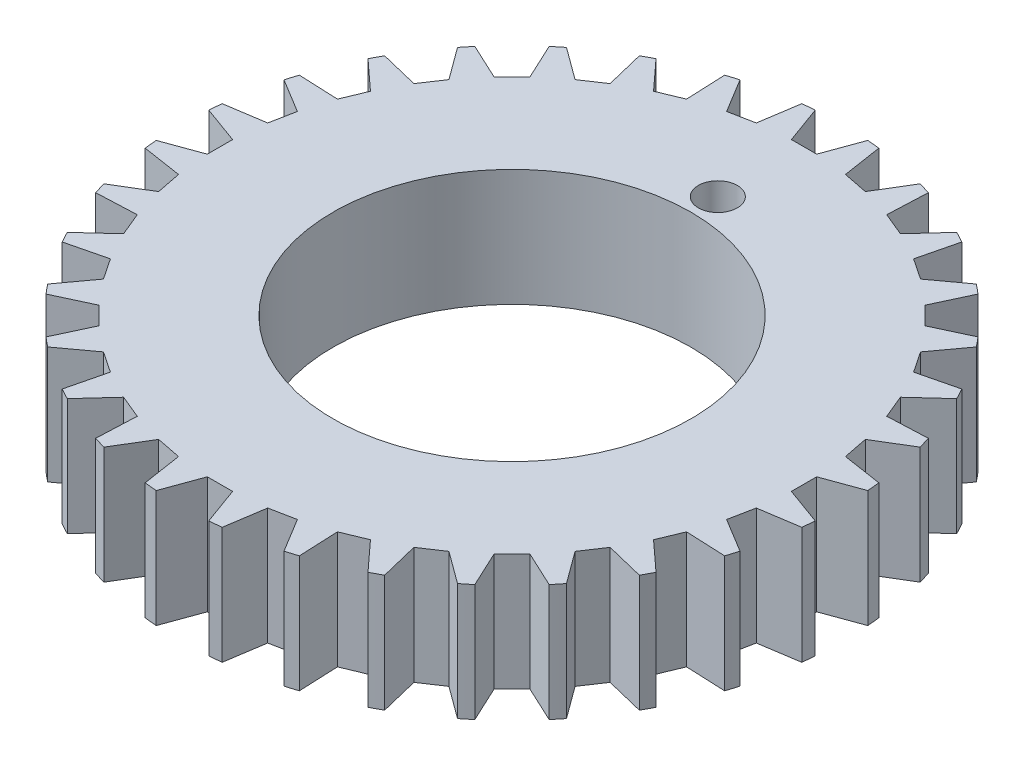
from build123d import *

# Parameters (mm, degrees)
SKETCH1_R           = 13.462
SKETCH1_R_2         = 3.175
EXTRUDE1_DEPTH      = 4.7625
SKETCH9_R           = 7.9375
SKETCH9_R_2         = 3.175
BOSS_EXTRUDE1_DEPTH = 6.35
CUT_EXTRUDE1_DEPTH  = 23.044013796
CIRPATTERN1_COUNT   = 32
CUT_EXTRUDE4_START  = -6.35
SKETCH11_R          = 7.9375
CUT_EXTRUDE4_DEPTH  = 6.35
SKETCH10_R          = 7.2898
CUT_EXTRUDE3_DEPTH  = 20.566391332
SKETCH8_R           = 0.79375
CUT_EXTRUDE2_DEPTH  = 20.566391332


with BuildPart() as part:
    # Sketch1 → Extrude1 (new body)
    with BuildSketch(Plane(origin=(0, 0, 0), x_dir=(1, 0, 0), z_dir=(0, 1, 0))):
        with Locations(Location((0, 0, 0), (0, 0, 90))):
            Circle(SKETCH1_R)
        with Locations(Location((0, 0, 0), (0, 0, 90))):
            Circle(SKETCH1_R_2, mode=Mode.SUBTRACT)
    extrude(amount=EXTRUDE1_DEPTH)

    # Sketch9 → Boss-Extrude1 (add)
    with BuildSketch(Plane(origin=(0, 4.7625, 0), x_dir=(1, 0, 0), z_dir=(0, 1, 0))):
        with Locations(Location((0, 0, 0), (0, 0, 90))):
            Circle(SKETCH9_R)
        with Locations(Location((0, 0, 0), (0, 0, 90))):
            Circle(SKETCH9_R_2, mode=Mode.SUBTRACT)
    extrude(amount=BOSS_EXTRUDE1_DEPTH)

    # Sketch6 → Cut-Extrude1 (cut, through all)
    with BuildSketch(Plane(origin=(0, 0, 0), x_dir=(-1, 0, 0), z_dir=(0, 1, 0))):
        Polygon((-13.462, -1.085219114), (-13.462, 1.085219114), (-11.89355, 0.51435), (-11.89355, -0.51435), align=None)
    cut_extrude1 = extrude(amount=CUT_EXTRUDE1_DEPTH, mode=Mode.SUBTRACT)

    # CirPattern1: Cut-Extrude1 ×32 about axis
    cirpattern1_axis = Axis((0, 0, 0), (0, 1, 0))
    for i in range(1, CIRPATTERN1_COUNT):
        add(cut_extrude1.rotate(cirpattern1_axis, i * 360 / CIRPATTERN1_COUNT), mode=Mode.SUBTRACT)

    # Sketch11 → Cut-Extrude4 (cut)
    with BuildSketch(Plane(origin=(0, 11.1125, 0), x_dir=(1, 0, 0), z_dir=(0, 1, 0)).offset(CUT_EXTRUDE4_START)):
        Circle(SKETCH11_R)
    extrude(amount=CUT_EXTRUDE4_DEPTH, mode=Mode.SUBTRACT)

    # Sketch10 → Cut-Extrude3 (cut, through all)
    with BuildSketch(Plane.XZ):
        with Locations(Location((0, 0, 0), (0, 0, 270))):
            Circle(SKETCH10_R)
    extrude(amount=-CUT_EXTRUDE3_DEPTH, mode=Mode.SUBTRACT)

    # Sketch8 → Cut-Extrude2 (cut, through all)
    with BuildSketch(Plane(origin=(0, 4.7625, 0), x_dir=(1, 0, 0), z_dir=(0, 1, 0))):
        with Locations(Location((0, 8.382, 0), (0, 0, 270))):
            Circle(SKETCH8_R)
    extrude(amount=-CUT_EXTRUDE2_DEPTH, mode=Mode.SUBTRACT)


solid = part.part
